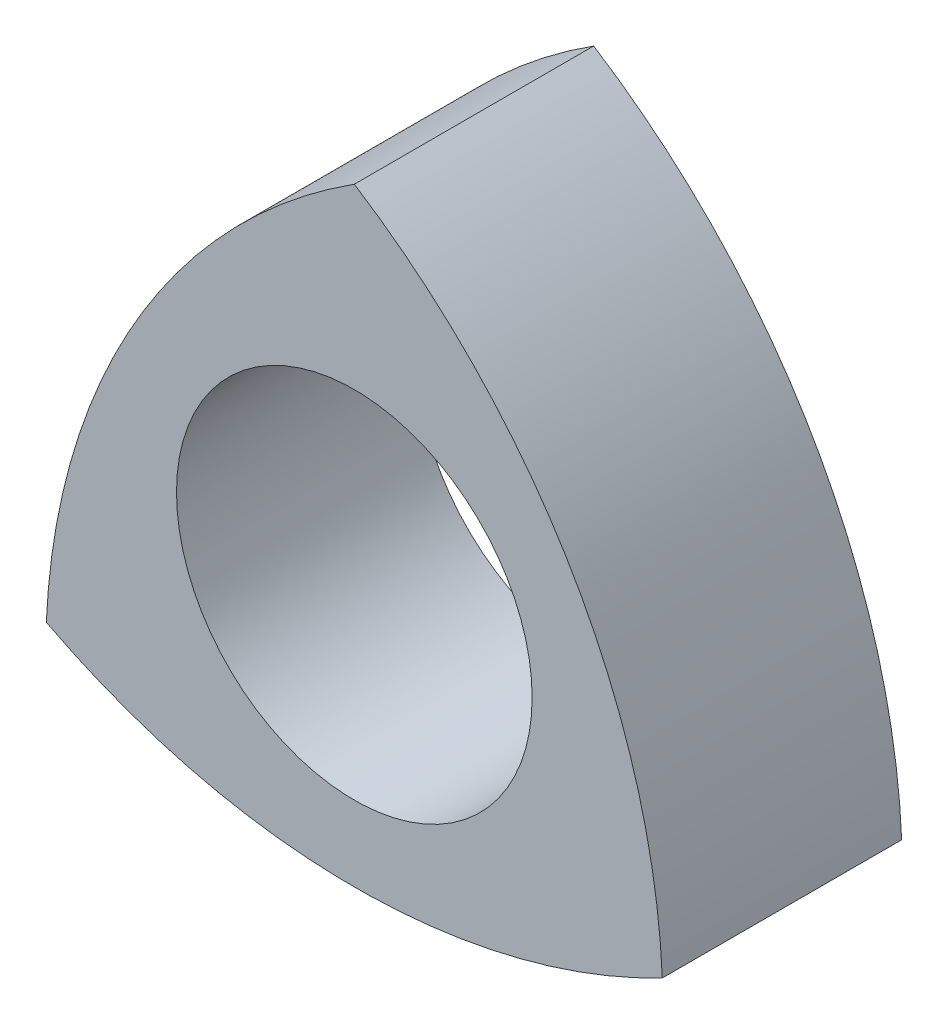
ISO-10303-21;
HEADER;
FILE_DESCRIPTION(('STEP AP214'),'2;1');
FILE_NAME('part.step','',(''),(''),'','','');
FILE_SCHEMA(('AUTOMOTIVE_DESIGN { 1 0 10303 214 1 1 1 1 }'));
ENDSEC;
DATA;
#1=APPLICATION_CONTEXT('core data for automotive mechanical design processes');
#2=APPLICATION_PROTOCOL_DEFINITION('international standard','automotive_design',2000,#1);
#3=PRODUCT_CONTEXT('',#1,'mechanical');
#4=PRODUCT('Part','Part','',(#3));
#5=PRODUCT_RELATED_PRODUCT_CATEGORY('part','',(#4));
#6=PRODUCT_DEFINITION_FORMATION('','',#4);
#7=PRODUCT_DEFINITION_CONTEXT('part definition',#1,'design');
#8=PRODUCT_DEFINITION('design','',#6,#7);
#9=PRODUCT_DEFINITION_SHAPE('','',#8);
#10=(LENGTH_UNIT() NAMED_UNIT(*) SI_UNIT(.MILLI.,.METRE.));
#11=(NAMED_UNIT(*) PLANE_ANGLE_UNIT() SI_UNIT($,.RADIAN.));
#12=(NAMED_UNIT(*) SI_UNIT($,.STERADIAN.) SOLID_ANGLE_UNIT());
#13=UNCERTAINTY_MEASURE_WITH_UNIT(LENGTH_MEASURE(1.E-05),#10,'distance_accuracy_value','');
#14=(GEOMETRIC_REPRESENTATION_CONTEXT(3) GLOBAL_UNCERTAINTY_ASSIGNED_CONTEXT((#13)) GLOBAL_UNIT_ASSIGNED_CONTEXT((#10,
#11,#12)) REPRESENTATION_CONTEXT('',''));
#15=CARTESIAN_POINT('',(0.,0.,0.));
#16=DIRECTION('',(0.,0.,1.));
#17=DIRECTION('',(1.,0.,0.));
#18=AXIS2_PLACEMENT_3D('',#15,#16,#17);
#19=CARTESIAN_POINT('',(133.482074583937,77.0659116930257,177.8));
#20=DIRECTION('',(0.,0.,1.));
#21=DIRECTION('',(1.,0.,0.));
#22=AXIS2_PLACEMENT_3D('',#19,#20,#21);
#23=PLANE('',#22);
#24=CARTESIAN_POINT('',(266.964149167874,-154.131823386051,177.8));
#25=DIRECTION('',(0.,0.,1.));
#26=DIRECTION('',(1.,0.,0.));
#27=AXIS2_PLACEMENT_3D('',#24,#25,#26);
#28=CIRCLE('',#27,496.2236456);
#29=CARTESIAN_POINT('',(0.,264.16,177.8));
#30=VERTEX_POINT('',#29);
#31=CARTESIAN_POINT('',(-228.769270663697,-132.08,177.8));
#32=VERTEX_POINT('',#31);
#33=EDGE_CURVE('E78',#30,#32,#28,.T.);
#34=ORIENTED_EDGE('',*,*,#33,.T.);
#35=CARTESIAN_POINT('',(0.,308.263646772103,177.8));
#36=DIRECTION('',(0.,0.,1.));
#37=DIRECTION('',(1.,0.,0.));
#38=AXIS2_PLACEMENT_3D('',#35,#36,#37);
#39=CIRCLE('',#38,496.2236456);
#40=CARTESIAN_POINT('',(228.769270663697,-132.08,177.8));
#41=VERTEX_POINT('',#40);
#42=EDGE_CURVE('E74',#32,#41,#39,.T.);
#43=ORIENTED_EDGE('',*,*,#42,.T.);
#44=CARTESIAN_POINT('',(-266.964149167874,-154.131823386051,177.8));
#45=DIRECTION('',(0.,0.,1.));
#46=DIRECTION('',(-1.,0.,0.));
#47=AXIS2_PLACEMENT_3D('',#44,#45,#46);
#48=CIRCLE('',#47,496.2236456);
#49=EDGE_CURVE('E54',#41,#30,#48,.T.);
#50=ORIENTED_EDGE('',*,*,#49,.T.);
#51=EDGE_LOOP('',(#34,#43,#50));
#52=FACE_BOUND('',#51,.T.);
#53=CARTESIAN_POINT('',(0.,0.,177.8));
#54=DIRECTION('',(0.,0.,1.));
#55=DIRECTION('',(1.,0.,0.));
#56=AXIS2_PLACEMENT_3D('',#53,#54,#55);
#57=CIRCLE('',#56,132.08);
#58=CARTESIAN_POINT('',(132.08,0.,177.8));
#59=VERTEX_POINT('',#58);
#60=EDGE_CURVE('E88',#59,#59,#57,.T.);
#61=ORIENTED_EDGE('',*,*,#60,.F.);
#62=EDGE_LOOP('',(#61));
#63=FACE_BOUND('',#62,.T.);
#64=ADVANCED_FACE('F37',(#52,#63),#23,.T.);
#65=CARTESIAN_POINT('',(133.482074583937,77.0659116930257,0.));
#66=DIRECTION('',(0.,0.,1.));
#67=DIRECTION('',(1.,0.,0.));
#68=AXIS2_PLACEMENT_3D('',#65,#66,#67);
#69=PLANE('',#68);
#70=CARTESIAN_POINT('',(266.964149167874,-154.131823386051,0.));
#71=DIRECTION('',(0.,0.,1.));
#72=DIRECTION('',(1.,0.,0.));
#73=AXIS2_PLACEMENT_3D('',#70,#71,#72);
#74=CIRCLE('',#73,496.2236456);
#75=CARTESIAN_POINT('',(0.,264.16,0.));
#76=VERTEX_POINT('',#75);
#77=CARTESIAN_POINT('',(-228.769270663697,-132.08,0.));
#78=VERTEX_POINT('',#77);
#79=EDGE_CURVE('E85',#76,#78,#74,.T.);
#80=ORIENTED_EDGE('',*,*,#79,.F.);
#81=CARTESIAN_POINT('',(-266.964149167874,-154.131823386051,0.));
#82=DIRECTION('',(0.,0.,1.));
#83=DIRECTION('',(-1.,0.,0.));
#84=AXIS2_PLACEMENT_3D('',#81,#82,#83);
#85=CIRCLE('',#84,496.2236456);
#86=CARTESIAN_POINT('',(228.769270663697,-132.08,0.));
#87=VERTEX_POINT('',#86);
#88=EDGE_CURVE('E71',#87,#76,#85,.T.);
#89=ORIENTED_EDGE('',*,*,#88,.F.);
#90=CARTESIAN_POINT('',(0.,308.263646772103,0.));
#91=DIRECTION('',(0.,0.,1.));
#92=DIRECTION('',(1.,0.,0.));
#93=AXIS2_PLACEMENT_3D('',#90,#91,#92);
#94=CIRCLE('',#93,496.2236456);
#95=EDGE_CURVE('E66',#78,#87,#94,.T.);
#96=ORIENTED_EDGE('',*,*,#95,.F.);
#97=EDGE_LOOP('',(#80,#89,#96));
#98=FACE_BOUND('',#97,.T.);
#99=CARTESIAN_POINT('',(0.,0.,0.));
#100=DIRECTION('',(0.,0.,1.));
#101=DIRECTION('',(1.,0.,0.));
#102=AXIS2_PLACEMENT_3D('',#99,#100,#101);
#103=CIRCLE('',#102,132.08);
#104=CARTESIAN_POINT('',(132.08,0.,0.));
#105=VERTEX_POINT('',#104);
#106=EDGE_CURVE('E92',#105,#105,#103,.T.);
#107=ORIENTED_EDGE('',*,*,#106,.T.);
#108=EDGE_LOOP('',(#107));
#109=FACE_BOUND('',#108,.T.);
#110=ADVANCED_FACE('F98',(#98,#109),#69,.F.);
#111=CARTESIAN_POINT('',(266.964149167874,-154.131823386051,177.8));
#112=DIRECTION('',(0.,0.,-1.));
#113=DIRECTION('',(-1.,0.,0.));
#114=AXIS2_PLACEMENT_3D('',#111,#112,#113);
#115=CYLINDRICAL_SURFACE('',#114,496.2236456);
#116=ORIENTED_EDGE('',*,*,#79,.T.);
#117=DIRECTION('',(0.,0.,-1.));
#118=VECTOR('',#117,1.);
#119=CARTESIAN_POINT('',(-228.769270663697,-132.08,177.8));
#120=LINE('',#119,#118);
#121=EDGE_CURVE('E11',#32,#78,#120,.T.);
#122=ORIENTED_EDGE('',*,*,#121,.F.);
#123=ORIENTED_EDGE('',*,*,#33,.F.);
#124=DIRECTION('',(0.,0.,-1.));
#125=VECTOR('',#124,1.);
#126=CARTESIAN_POINT('',(0.,264.16,177.8));
#127=LINE('',#126,#125);
#128=EDGE_CURVE('E86',#30,#76,#127,.T.);
#129=ORIENTED_EDGE('',*,*,#128,.T.);
#130=EDGE_LOOP('',(#116,#122,#123,#129));
#131=FACE_BOUND('',#130,.T.);
#132=ADVANCED_FACE('F39',(#131),#115,.T.);
#133=CARTESIAN_POINT('',(0.,308.263646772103,177.8));
#134=DIRECTION('',(0.,0.,-1.));
#135=DIRECTION('',(-1.,0.,0.));
#136=AXIS2_PLACEMENT_3D('',#133,#134,#135);
#137=CYLINDRICAL_SURFACE('',#136,496.2236456);
#138=ORIENTED_EDGE('',*,*,#95,.T.);
#139=DIRECTION('',(0.,0.,-1.));
#140=VECTOR('',#139,1.);
#141=CARTESIAN_POINT('',(228.769270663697,-132.08,177.8));
#142=LINE('',#141,#140);
#143=EDGE_CURVE('E46',#41,#87,#142,.T.);
#144=ORIENTED_EDGE('',*,*,#143,.F.);
#145=ORIENTED_EDGE('',*,*,#42,.F.);
#146=ORIENTED_EDGE('',*,*,#121,.T.);
#147=EDGE_LOOP('',(#138,#144,#145,#146));
#148=FACE_BOUND('',#147,.T.);
#149=ADVANCED_FACE('F75',(#148),#137,.T.);
#150=CARTESIAN_POINT('',(-266.964149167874,-154.131823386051,177.8));
#151=DIRECTION('',(0.,0.,-1.));
#152=DIRECTION('',(-1.,0.,0.));
#153=AXIS2_PLACEMENT_3D('',#150,#151,#152);
#154=CYLINDRICAL_SURFACE('',#153,496.2236456);
#155=ORIENTED_EDGE('',*,*,#88,.T.);
#156=ORIENTED_EDGE('',*,*,#128,.F.);
#157=ORIENTED_EDGE('',*,*,#49,.F.);
#158=ORIENTED_EDGE('',*,*,#143,.T.);
#159=EDGE_LOOP('',(#155,#156,#157,#158));
#160=FACE_BOUND('',#159,.T.);
#161=ADVANCED_FACE('F97',(#160),#154,.T.);
#162=CARTESIAN_POINT('',(0.,0.,177.8));
#163=DIRECTION('',(0.,0.,-1.));
#164=DIRECTION('',(-1.,0.,0.));
#165=AXIS2_PLACEMENT_3D('',#162,#163,#164);
#166=CYLINDRICAL_SURFACE('',#165,132.08);
#167=ORIENTED_EDGE('',*,*,#60,.T.);
#168=EDGE_LOOP('',(#167));
#169=FACE_BOUND('',#168,.T.);
#170=ORIENTED_EDGE('',*,*,#106,.F.);
#171=EDGE_LOOP('',(#170));
#172=FACE_BOUND('',#171,.T.);
#173=ADVANCED_FACE('F106',(#169,#172),#166,.F.);
#174=CLOSED_SHELL('',(#64,#110,#132,#149,#161,#173));
#175=MANIFOLD_SOLID_BREP('B2',#174);
#176=ADVANCED_BREP_SHAPE_REPRESENTATION('',(#18,#175),#14);
#177=SHAPE_DEFINITION_REPRESENTATION(#9,#176);
ENDSEC;
END-ISO-10303-21;
